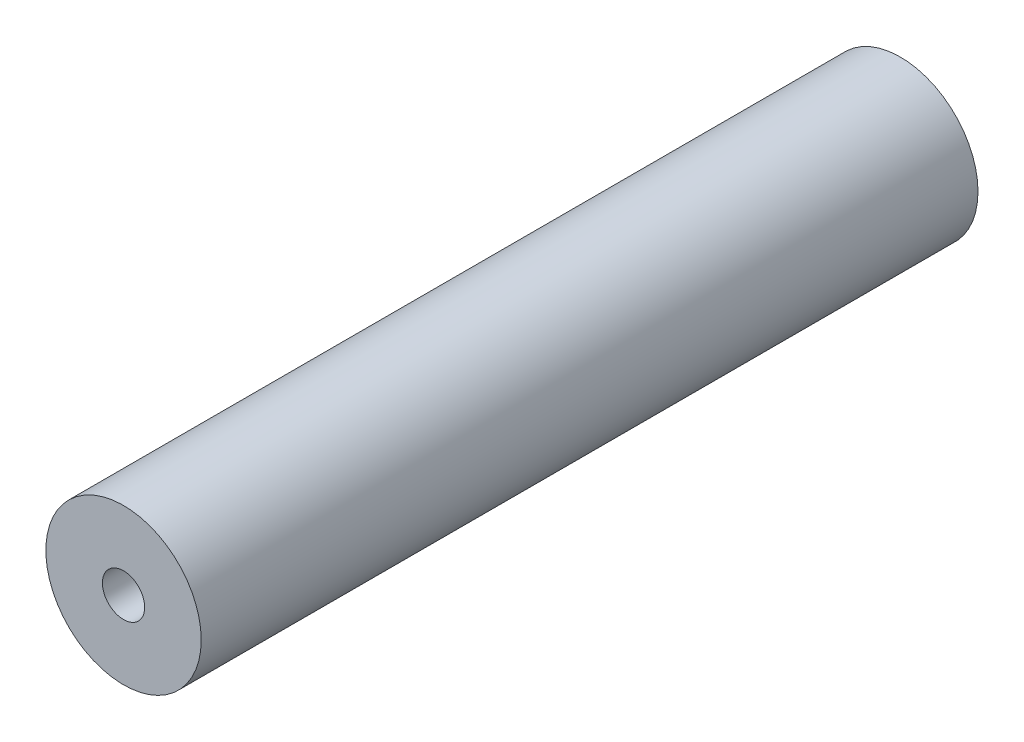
from build123d import *

# Parameters (mm, degrees)
ESQUISSE1_R           = 12.5
EXTRUSION1_DEPTH      = 62.5
TROU_TARAUD_M81_D     = 6.8
TROU_TARAUD_M81_DEPTH = 22.25
TROU_TARAUD_M81_TIP   = 2.042926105
TROU_TARAUD_M82_D     = 6.8
TROU_TARAUD_M82_DEPTH = 22.25
TROU_TARAUD_M82_TIP   = 2.042926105


with BuildPart() as part:
    # Esquisse1 → Extrusion1 (new, symmetric)
    with BuildSketch(Plane.XY):
        Circle(ESQUISSE1_R)
    extrude(amount=EXTRUSION1_DEPTH, both=True)

    # Trou taraud_ M81
    with Locations(Plane.XY.offset(62.5)):
        with Locations((0, 0)):
            Hole(TROU_TARAUD_M81_D / 2, depth=TROU_TARAUD_M81_DEPTH)
            with Locations((0, 0, -(TROU_TARAUD_M81_DEPTH + TROU_TARAUD_M81_TIP / 2))):  # 118° drill point
                Cone(0, TROU_TARAUD_M81_D / 2, TROU_TARAUD_M81_TIP, mode=Mode.SUBTRACT)

    # Trou taraud_ M82
    with Locations(Plane(origin=(0, 0, -62.5), x_dir=(-1, 0, 0), z_dir=(0, 0, -1))):
        with Locations((0, 0)):
            Hole(TROU_TARAUD_M82_D / 2, depth=TROU_TARAUD_M82_DEPTH)
            with Locations((0, 0, -(TROU_TARAUD_M82_DEPTH + TROU_TARAUD_M82_TIP / 2))):  # 118° drill point
                Cone(0, TROU_TARAUD_M82_D / 2, TROU_TARAUD_M82_TIP, mode=Mode.SUBTRACT)


solid = part.part
